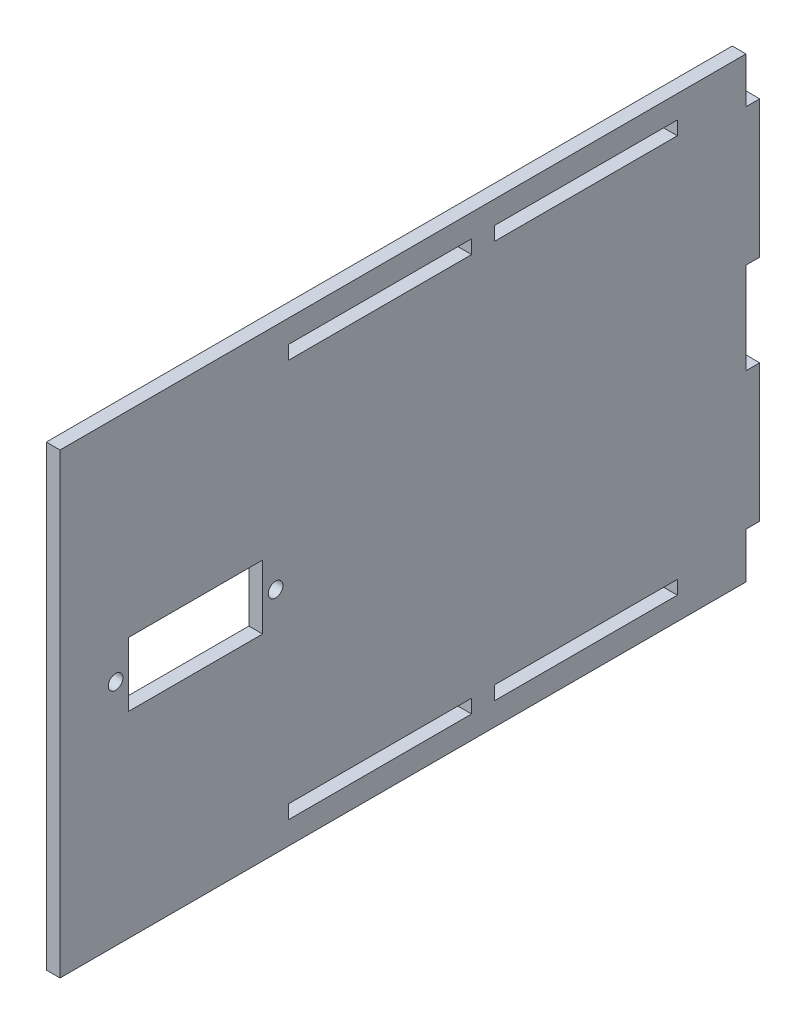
ISO-10303-21;
HEADER;
FILE_DESCRIPTION(('STEP AP214'),'2;1');
FILE_NAME('part.step','',(''),(''),'','','');
FILE_SCHEMA(('AUTOMOTIVE_DESIGN { 1 0 10303 214 1 1 1 1 }'));
ENDSEC;
DATA;
#1=APPLICATION_CONTEXT('core data for automotive mechanical design processes');
#2=APPLICATION_PROTOCOL_DEFINITION('international standard','automotive_design',2000,#1);
#3=PRODUCT_CONTEXT('',#1,'mechanical');
#4=PRODUCT('Part','Part','',(#3));
#5=PRODUCT_RELATED_PRODUCT_CATEGORY('part','',(#4));
#6=PRODUCT_DEFINITION_FORMATION('','',#4);
#7=PRODUCT_DEFINITION_CONTEXT('part definition',#1,'design');
#8=PRODUCT_DEFINITION('design','',#6,#7);
#9=PRODUCT_DEFINITION_SHAPE('','',#8);
#10=(LENGTH_UNIT() NAMED_UNIT(*) SI_UNIT(.MILLI.,.METRE.));
#11=(NAMED_UNIT(*) PLANE_ANGLE_UNIT() SI_UNIT($,.RADIAN.));
#12=(NAMED_UNIT(*) SI_UNIT($,.STERADIAN.) SOLID_ANGLE_UNIT());
#13=UNCERTAINTY_MEASURE_WITH_UNIT(LENGTH_MEASURE(1.E-05),#10,'distance_accuracy_value','');
#14=(GEOMETRIC_REPRESENTATION_CONTEXT(3) GLOBAL_UNCERTAINTY_ASSIGNED_CONTEXT((#13)) GLOBAL_UNIT_ASSIGNED_CONTEXT((#10,
#11,#12)) REPRESENTATION_CONTEXT('',''));
#15=CARTESIAN_POINT('',(0.,0.,0.));
#16=DIRECTION('',(0.,0.,1.));
#17=DIRECTION('',(1.,0.,0.));
#18=AXIS2_PLACEMENT_3D('',#15,#16,#17);
#19=CARTESIAN_POINT('',(0.,0.,0.));
#20=DIRECTION('',(0.,0.,1.));
#21=DIRECTION('',(1.,0.,0.));
#22=AXIS2_PLACEMENT_3D('',#19,#20,#21);
#23=PLANE('',#22);
#24=DIRECTION('',(0.,-1.,0.));
#25=VECTOR('',#24,1.);
#26=CARTESIAN_POINT('',(67.,-50.,0.));
#27=LINE('',#26,#25);
#28=CARTESIAN_POINT('',(67.,-40.,0.));
#29=VERTEX_POINT('',#28);
#30=CARTESIAN_POINT('',(67.,-50.,0.));
#31=VERTEX_POINT('',#30);
#32=EDGE_CURVE('E37',#29,#31,#27,.T.);
#33=ORIENTED_EDGE('',*,*,#32,.F.);
#34=DIRECTION('',(-1.,0.,0.));
#35=VECTOR('',#34,1.);
#36=CARTESIAN_POINT('',(67.,-40.,0.));
#37=LINE('',#36,#35);
#38=CARTESIAN_POINT('',(70.,-40.,0.));
#39=VERTEX_POINT('',#38);
#40=EDGE_CURVE('E440',#39,#29,#37,.T.);
#41=ORIENTED_EDGE('',*,*,#40,.F.);
#42=DIRECTION('',(0.,1.,0.));
#43=VECTOR('',#42,1.);
#44=CARTESIAN_POINT('',(70.,-50.,0.));
#45=LINE('',#44,#43);
#46=CARTESIAN_POINT('',(70.,-50.,0.));
#47=VERTEX_POINT('',#46);
#48=EDGE_CURVE('E482',#47,#39,#45,.T.);
#49=ORIENTED_EDGE('',*,*,#48,.F.);
#50=DIRECTION('',(1.,0.,0.));
#51=VECTOR('',#50,1.);
#52=CARTESIAN_POINT('',(70.,-50.,0.));
#53=LINE('',#52,#51);
#54=EDGE_CURVE('E487',#31,#47,#53,.T.);
#55=ORIENTED_EDGE('',*,*,#54,.F.);
#56=EDGE_LOOP('',(#33,#41,#49,#55));
#57=FACE_BOUND('',#56,.T.);
#58=ADVANCED_FACE('F33',(#57),#23,.F.);
#59=DIRECTION('',(1.,0.,0.));
#60=VECTOR('',#59,1.);
#61=CARTESIAN_POINT('',(70.,40.,0.));
#62=LINE('',#61,#60);
#63=CARTESIAN_POINT('',(67.,40.,0.));
#64=VERTEX_POINT('',#63);
#65=CARTESIAN_POINT('',(70.,40.,0.));
#66=VERTEX_POINT('',#65);
#67=EDGE_CURVE('E466',#64,#66,#62,.T.);
#68=ORIENTED_EDGE('',*,*,#67,.F.);
#69=CARTESIAN_POINT('',(67.,50.,0.));
#70=VERTEX_POINT('',#69);
#71=EDGE_CURVE('E500',#70,#64,#27,.T.);
#72=ORIENTED_EDGE('',*,*,#71,.F.);
#73=DIRECTION('',(-1.,0.,0.));
#74=VECTOR('',#73,1.);
#75=CARTESIAN_POINT('',(70.,50.,0.));
#76=LINE('',#75,#74);
#77=CARTESIAN_POINT('',(70.,50.,0.));
#78=VERTEX_POINT('',#77);
#79=EDGE_CURVE('E488',#78,#70,#76,.T.);
#80=ORIENTED_EDGE('',*,*,#79,.F.);
#81=EDGE_CURVE('E483',#66,#78,#45,.T.);
#82=ORIENTED_EDGE('',*,*,#81,.F.);
#83=EDGE_LOOP('',(#68,#72,#80,#82));
#84=FACE_BOUND('',#83,.T.);
#85=ADVANCED_FACE('F530',(#84),#23,.F.);
#86=CARTESIAN_POINT('',(70.,-10.,0.));
#87=VERTEX_POINT('',#86);
#88=CARTESIAN_POINT('',(70.,9.99999999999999,0.));
#89=VERTEX_POINT('',#88);
#90=EDGE_CURVE('E480',#87,#89,#45,.T.);
#91=ORIENTED_EDGE('',*,*,#90,.F.);
#92=DIRECTION('',(1.,0.,0.));
#93=VECTOR('',#92,1.);
#94=CARTESIAN_POINT('',(70.,-10.,0.));
#95=LINE('',#94,#93);
#96=CARTESIAN_POINT('',(67.,-10.,0.));
#97=VERTEX_POINT('',#96);
#98=EDGE_CURVE('E435',#97,#87,#95,.T.);
#99=ORIENTED_EDGE('',*,*,#98,.F.);
#100=CARTESIAN_POINT('',(67.,9.99999999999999,0.));
#101=VERTEX_POINT('',#100);
#102=EDGE_CURVE('E497',#101,#97,#27,.T.);
#103=ORIENTED_EDGE('',*,*,#102,.F.);
#104=DIRECTION('',(-1.,0.,0.));
#105=VECTOR('',#104,1.);
#106=CARTESIAN_POINT('',(67.,9.99999999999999,0.));
#107=LINE('',#106,#105);
#108=EDGE_CURVE('E552',#89,#101,#107,.T.);
#109=ORIENTED_EDGE('',*,*,#108,.F.);
#110=EDGE_LOOP('',(#91,#99,#103,#109));
#111=FACE_BOUND('',#110,.T.);
#112=ADVANCED_FACE('F560',(#111),#23,.F.);
#113=CARTESIAN_POINT('',(67.,-50.,150.));
#114=DIRECTION('',(1.,0.,0.));
#115=DIRECTION('',(0.,0.,-1.));
#116=AXIS2_PLACEMENT_3D('',#113,#114,#115);
#117=PLANE('',#116);
#118=DIRECTION('',(0.,0.,1.));
#119=VECTOR('',#118,1.);
#120=CARTESIAN_POINT('',(67.,45.,150.));
#121=LINE('',#120,#119);
#122=CARTESIAN_POINT('',(67.,45.,15.));
#123=VERTEX_POINT('',#122);
#124=CARTESIAN_POINT('',(67.,45.,55.));
#125=VERTEX_POINT('',#124);
#126=EDGE_CURVE('E276',#123,#125,#121,.T.);
#127=ORIENTED_EDGE('',*,*,#126,.T.);
#128=DIRECTION('',(0.,-1.,0.));
#129=VECTOR('',#128,1.);
#130=CARTESIAN_POINT('',(67.,-50.,55.));
#131=LINE('',#130,#129);
#132=CARTESIAN_POINT('',(67.,42.,55.));
#133=VERTEX_POINT('',#132);
#134=EDGE_CURVE('E279',#125,#133,#131,.T.);
#135=ORIENTED_EDGE('',*,*,#134,.T.);
#136=DIRECTION('',(0.,0.,-1.));
#137=VECTOR('',#136,1.);
#138=CARTESIAN_POINT('',(67.,42.,150.));
#139=LINE('',#138,#137);
#140=CARTESIAN_POINT('',(67.,42.,15.));
#141=VERTEX_POINT('',#140);
#142=EDGE_CURVE('E271',#133,#141,#139,.T.);
#143=ORIENTED_EDGE('',*,*,#142,.T.);
#144=DIRECTION('',(0.,1.,0.));
#145=VECTOR('',#144,1.);
#146=CARTESIAN_POINT('',(67.,-50.,15.));
#147=LINE('',#146,#145);
#148=EDGE_CURVE('E251',#141,#123,#147,.T.);
#149=ORIENTED_EDGE('',*,*,#148,.T.);
#150=EDGE_LOOP('',(#127,#135,#143,#149));
#151=FACE_BOUND('',#150,.T.);
#152=DIRECTION('',(0.,0.,-1.));
#153=VECTOR('',#152,1.);
#154=CARTESIAN_POINT('',(67.,-45.,150.));
#155=LINE('',#154,#153);
#156=CARTESIAN_POINT('',(67.,-45.,55.));
#157=VERTEX_POINT('',#156);
#158=CARTESIAN_POINT('',(67.,-45.,15.));
#159=VERTEX_POINT('',#158);
#160=EDGE_CURVE('E308',#157,#159,#155,.T.);
#161=ORIENTED_EDGE('',*,*,#160,.T.);
#162=DIRECTION('',(0.,1.,0.));
#163=VECTOR('',#162,1.);
#164=CARTESIAN_POINT('',(67.,-50.,15.));
#165=LINE('',#164,#163);
#166=CARTESIAN_POINT('',(67.,-42.,15.));
#167=VERTEX_POINT('',#166);
#168=EDGE_CURVE('E311',#159,#167,#165,.T.);
#169=ORIENTED_EDGE('',*,*,#168,.T.);
#170=DIRECTION('',(0.,0.,1.));
#171=VECTOR('',#170,1.);
#172=CARTESIAN_POINT('',(67.,-42.,150.));
#173=LINE('',#172,#171);
#174=CARTESIAN_POINT('',(67.,-42.,55.));
#175=VERTEX_POINT('',#174);
#176=EDGE_CURVE('E296',#167,#175,#173,.T.);
#177=ORIENTED_EDGE('',*,*,#176,.T.);
#178=DIRECTION('',(0.,-1.,0.));
#179=VECTOR('',#178,1.);
#180=CARTESIAN_POINT('',(67.,-50.,55.));
#181=LINE('',#180,#179);
#182=EDGE_CURVE('E305',#175,#157,#181,.T.);
#183=ORIENTED_EDGE('',*,*,#182,.T.);
#184=EDGE_LOOP('',(#161,#169,#177,#183));
#185=FACE_BOUND('',#184,.T.);
#186=DIRECTION('',(0.,0.,1.));
#187=VECTOR('',#186,1.);
#188=CARTESIAN_POINT('',(67.,45.,150.));
#189=LINE('',#188,#187);
#190=CARTESIAN_POINT('',(67.,45.,60.));
#191=VERTEX_POINT('',#190);
#192=CARTESIAN_POINT('',(67.,45.,100.));
#193=VERTEX_POINT('',#192);
#194=EDGE_CURVE('E340',#191,#193,#189,.T.);
#195=ORIENTED_EDGE('',*,*,#194,.T.);
#196=DIRECTION('',(0.,-1.,0.));
#197=VECTOR('',#196,1.);
#198=CARTESIAN_POINT('',(67.,-50.,100.));
#199=LINE('',#198,#197);
#200=CARTESIAN_POINT('',(67.,42.,100.));
#201=VERTEX_POINT('',#200);
#202=EDGE_CURVE('E343',#193,#201,#199,.T.);
#203=ORIENTED_EDGE('',*,*,#202,.T.);
#204=DIRECTION('',(0.,0.,-1.));
#205=VECTOR('',#204,1.);
#206=CARTESIAN_POINT('',(67.,42.,150.));
#207=LINE('',#206,#205);
#208=CARTESIAN_POINT('',(67.,42.,60.));
#209=VERTEX_POINT('',#208);
#210=EDGE_CURVE('E328',#201,#209,#207,.T.);
#211=ORIENTED_EDGE('',*,*,#210,.T.);
#212=DIRECTION('',(0.,1.,0.));
#213=VECTOR('',#212,1.);
#214=CARTESIAN_POINT('',(67.,-50.,60.));
#215=LINE('',#214,#213);
#216=EDGE_CURVE('E337',#209,#191,#215,.T.);
#217=ORIENTED_EDGE('',*,*,#216,.T.);
#218=EDGE_LOOP('',(#195,#203,#211,#217));
#219=FACE_BOUND('',#218,.T.);
#220=DIRECTION('',(0.,0.,-1.));
#221=VECTOR('',#220,1.);
#222=CARTESIAN_POINT('',(67.,-45.,150.));
#223=LINE('',#222,#221);
#224=CARTESIAN_POINT('',(67.,-45.,100.));
#225=VERTEX_POINT('',#224);
#226=CARTESIAN_POINT('',(67.,-45.,60.));
#227=VERTEX_POINT('',#226);
#228=EDGE_CURVE('E372',#225,#227,#223,.T.);
#229=ORIENTED_EDGE('',*,*,#228,.T.);
#230=DIRECTION('',(0.,1.,0.));
#231=VECTOR('',#230,1.);
#232=CARTESIAN_POINT('',(67.,-50.,60.));
#233=LINE('',#232,#231);
#234=CARTESIAN_POINT('',(67.,-42.,60.));
#235=VERTEX_POINT('',#234);
#236=EDGE_CURVE('E375',#227,#235,#233,.T.);
#237=ORIENTED_EDGE('',*,*,#236,.T.);
#238=DIRECTION('',(0.,0.,1.));
#239=VECTOR('',#238,1.);
#240=CARTESIAN_POINT('',(67.,-42.,150.));
#241=LINE('',#240,#239);
#242=CARTESIAN_POINT('',(67.,-42.,100.));
#243=VERTEX_POINT('',#242);
#244=EDGE_CURVE('E360',#235,#243,#241,.T.);
#245=ORIENTED_EDGE('',*,*,#244,.T.);
#246=DIRECTION('',(0.,-1.,0.));
#247=VECTOR('',#246,1.);
#248=CARTESIAN_POINT('',(67.,-50.,100.));
#249=LINE('',#248,#247);
#250=EDGE_CURVE('E369',#243,#225,#249,.T.);
#251=ORIENTED_EDGE('',*,*,#250,.T.);
#252=EDGE_LOOP('',(#229,#237,#245,#251));
#253=FACE_BOUND('',#252,.T.);
#254=CARTESIAN_POINT('',(67.,0.,102.85));
#255=DIRECTION('',(1.,0.,0.));
#256=DIRECTION('',(0.,0.,-1.));
#257=AXIS2_PLACEMENT_3D('',#254,#255,#256);
#258=CIRCLE('',#257,1.60000000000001);
#259=CARTESIAN_POINT('',(67.,0.,101.25));
#260=VERTEX_POINT('',#259);
#261=EDGE_CURVE('E381',#260,#260,#258,.T.);
#262=ORIENTED_EDGE('',*,*,#261,.T.);
#263=EDGE_LOOP('',(#262));
#264=FACE_BOUND('',#263,.T.);
#265=CARTESIAN_POINT('',(67.,0.,137.85));
#266=DIRECTION('',(1.,0.,0.));
#267=DIRECTION('',(0.,0.,-1.));
#268=AXIS2_PLACEMENT_3D('',#265,#266,#267);
#269=CIRCLE('',#268,1.59999999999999);
#270=CARTESIAN_POINT('',(67.,0.,136.25));
#271=VERTEX_POINT('',#270);
#272=EDGE_CURVE('E387',#271,#271,#269,.T.);
#273=ORIENTED_EDGE('',*,*,#272,.T.);
#274=EDGE_LOOP('',(#273));
#275=FACE_BOUND('',#274,.T.);
#276=DIRECTION('',(0.,0.,1.));
#277=VECTOR('',#276,1.);
#278=CARTESIAN_POINT('',(67.,6.99999999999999,150.));
#279=LINE('',#278,#277);
#280=CARTESIAN_POINT('',(67.,7.,105.7));
#281=VERTEX_POINT('',#280);
#282=CARTESIAN_POINT('',(67.,7.,135.));
#283=VERTEX_POINT('',#282);
#284=EDGE_CURVE('E416',#281,#283,#279,.T.);
#285=ORIENTED_EDGE('',*,*,#284,.T.);
#286=DIRECTION('',(0.,-1.,0.));
#287=VECTOR('',#286,1.);
#288=CARTESIAN_POINT('',(67.,-50.,135.));
#289=LINE('',#288,#287);
#290=CARTESIAN_POINT('',(67.,-7.,135.));
#291=VERTEX_POINT('',#290);
#292=EDGE_CURVE('E419',#283,#291,#289,.T.);
#293=ORIENTED_EDGE('',*,*,#292,.T.);
#294=DIRECTION('',(0.,0.,-1.));
#295=VECTOR('',#294,1.);
#296=CARTESIAN_POINT('',(67.,-7.00000000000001,150.));
#297=LINE('',#296,#295);
#298=CARTESIAN_POINT('',(67.,-7.,105.7));
#299=VERTEX_POINT('',#298);
#300=EDGE_CURVE('E404',#291,#299,#297,.T.);
#301=ORIENTED_EDGE('',*,*,#300,.T.);
#302=DIRECTION('',(0.,1.,0.));
#303=VECTOR('',#302,1.);
#304=CARTESIAN_POINT('',(67.,-50.,105.7));
#305=LINE('',#304,#303);
#306=EDGE_CURVE('E413',#299,#281,#305,.T.);
#307=ORIENTED_EDGE('',*,*,#306,.T.);
#308=EDGE_LOOP('',(#285,#293,#301,#307));
#309=FACE_BOUND('',#308,.T.);
#310=ORIENTED_EDGE('',*,*,#71,.T.);
#311=DIRECTION('',(0.,0.,-1.));
#312=VECTOR('',#311,1.);
#313=CARTESIAN_POINT('',(67.,40.,30.1496268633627));
#314=LINE('',#313,#312);
#315=CARTESIAN_POINT('',(67.,40.,-3.));
#316=VERTEX_POINT('',#315);
#317=EDGE_CURVE('E471',#64,#316,#314,.T.);
#318=ORIENTED_EDGE('',*,*,#317,.T.);
#319=DIRECTION('',(0.,1.,0.));
#320=VECTOR('',#319,1.);
#321=CARTESIAN_POINT('',(67.,40.,-3.));
#322=LINE('',#321,#320);
#323=CARTESIAN_POINT('',(67.,9.99999999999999,-3.));
#324=VERTEX_POINT('',#323);
#325=EDGE_CURVE('E449',#324,#316,#322,.T.);
#326=ORIENTED_EDGE('',*,*,#325,.F.);
#327=DIRECTION('',(0.,0.,-1.));
#328=VECTOR('',#327,1.);
#329=CARTESIAN_POINT('',(67.,9.99999999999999,30.1496268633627));
#330=LINE('',#329,#328);
#331=EDGE_CURVE('E478',#101,#324,#330,.T.);
#332=ORIENTED_EDGE('',*,*,#331,.F.);
#333=ORIENTED_EDGE('',*,*,#102,.T.);
#334=DIRECTION('',(0.,0.,-1.));
#335=VECTOR('',#334,1.);
#336=CARTESIAN_POINT('',(67.,-10.,30.1496268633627));
#337=LINE('',#336,#335);
#338=CARTESIAN_POINT('',(67.,-10.,-3.));
#339=VERTEX_POINT('',#338);
#340=EDGE_CURVE('E439',#97,#339,#337,.T.);
#341=ORIENTED_EDGE('',*,*,#340,.T.);
#342=DIRECTION('',(0.,1.,0.));
#343=VECTOR('',#342,1.);
#344=CARTESIAN_POINT('',(67.,-10.,-3.));
#345=LINE('',#344,#343);
#346=CARTESIAN_POINT('',(67.,-40.,-3.));
#347=VERTEX_POINT('',#346);
#348=EDGE_CURVE('E423',#347,#339,#345,.T.);
#349=ORIENTED_EDGE('',*,*,#348,.F.);
#350=DIRECTION('',(0.,0.,-1.));
#351=VECTOR('',#350,1.);
#352=CARTESIAN_POINT('',(67.,-40.,30.1496268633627));
#353=LINE('',#352,#351);
#354=EDGE_CURVE('E443',#29,#347,#353,.T.);
#355=ORIENTED_EDGE('',*,*,#354,.F.);
#356=ORIENTED_EDGE('',*,*,#32,.T.);
#357=DIRECTION('',(0.,0.,-1.));
#358=VECTOR('',#357,1.);
#359=CARTESIAN_POINT('',(67.,-50.,150.));
#360=LINE('',#359,#358);
#361=CARTESIAN_POINT('',(67.,-50.,150.));
#362=VERTEX_POINT('',#361);
#363=EDGE_CURVE('E11',#362,#31,#360,.T.);
#364=ORIENTED_EDGE('',*,*,#363,.F.);
#365=DIRECTION('',(0.,-1.,0.));
#366=VECTOR('',#365,1.);
#367=CARTESIAN_POINT('',(67.,-50.,150.));
#368=LINE('',#367,#366);
#369=CARTESIAN_POINT('',(67.,50.,150.));
#370=VERTEX_POINT('',#369);
#371=EDGE_CURVE('E511',#370,#362,#368,.T.);
#372=ORIENTED_EDGE('',*,*,#371,.F.);
#373=DIRECTION('',(0.,0.,-1.));
#374=VECTOR('',#373,1.);
#375=CARTESIAN_POINT('',(67.,50.,150.));
#376=LINE('',#375,#374);
#377=EDGE_CURVE('E507',#370,#70,#376,.T.);
#378=ORIENTED_EDGE('',*,*,#377,.T.);
#379=EDGE_LOOP('',(#310,#318,#326,#332,#333,#341,#349,#355,#356,#364,#372,#378));
#380=FACE_BOUND('',#379,.T.);
#381=ADVANCED_FACE('F35',(#151,#185,#219,#253,#264,#275,#309,#380),#117,.F.);
#382=CARTESIAN_POINT('',(70.,-50.,150.));
#383=DIRECTION('',(0.,1.,0.));
#384=DIRECTION('',(0.,0.,1.));
#385=AXIS2_PLACEMENT_3D('',#382,#383,#384);
#386=PLANE('',#385);
#387=ORIENTED_EDGE('',*,*,#54,.T.);
#388=DIRECTION('',(0.,0.,-1.));
#389=VECTOR('',#388,1.);
#390=CARTESIAN_POINT('',(70.,-50.,150.));
#391=LINE('',#390,#389);
#392=CARTESIAN_POINT('',(70.,-50.,150.));
#393=VERTEX_POINT('',#392);
#394=EDGE_CURVE('E43',#393,#47,#391,.T.);
#395=ORIENTED_EDGE('',*,*,#394,.F.);
#396=DIRECTION('',(1.,0.,0.));
#397=VECTOR('',#396,1.);
#398=CARTESIAN_POINT('',(70.,-50.,150.));
#399=LINE('',#398,#397);
#400=EDGE_CURVE('E510',#362,#393,#399,.T.);
#401=ORIENTED_EDGE('',*,*,#400,.F.);
#402=ORIENTED_EDGE('',*,*,#363,.T.);
#403=EDGE_LOOP('',(#387,#395,#401,#402));
#404=FACE_BOUND('',#403,.T.);
#405=ADVANCED_FACE('F574',(#404),#386,.F.);
#406=CARTESIAN_POINT('',(70.,-50.,150.));
#407=DIRECTION('',(-1.,0.,0.));
#408=DIRECTION('',(0.,0.,1.));
#409=AXIS2_PLACEMENT_3D('',#406,#407,#408);
#410=PLANE('',#409);
#411=DIRECTION('',(0.,0.,-1.));
#412=VECTOR('',#411,1.);
#413=CARTESIAN_POINT('',(70.,42.,55.));
#414=LINE('',#413,#412);
#415=CARTESIAN_POINT('',(70.,42.,55.));
#416=VERTEX_POINT('',#415);
#417=CARTESIAN_POINT('',(70.,42.,15.));
#418=VERTEX_POINT('',#417);
#419=EDGE_CURVE('E257',#416,#418,#414,.T.);
#420=ORIENTED_EDGE('',*,*,#419,.F.);
#421=DIRECTION('',(0.,-1.,0.));
#422=VECTOR('',#421,1.);
#423=CARTESIAN_POINT('',(70.,45.,55.));
#424=LINE('',#423,#422);
#425=CARTESIAN_POINT('',(70.,45.,55.));
#426=VERTEX_POINT('',#425);
#427=EDGE_CURVE('E59',#426,#416,#424,.T.);
#428=ORIENTED_EDGE('',*,*,#427,.F.);
#429=DIRECTION('',(0.,0.,1.));
#430=VECTOR('',#429,1.);
#431=CARTESIAN_POINT('',(70.,45.,55.));
#432=LINE('',#431,#430);
#433=CARTESIAN_POINT('',(70.,45.,15.));
#434=VERTEX_POINT('',#433);
#435=EDGE_CURVE('E264',#434,#426,#432,.T.);
#436=ORIENTED_EDGE('',*,*,#435,.F.);
#437=DIRECTION('',(0.,1.,0.));
#438=VECTOR('',#437,1.);
#439=CARTESIAN_POINT('',(70.,45.,15.));
#440=LINE('',#439,#438);
#441=EDGE_CURVE('E248',#418,#434,#440,.T.);
#442=ORIENTED_EDGE('',*,*,#441,.F.);
#443=EDGE_LOOP('',(#420,#428,#436,#442));
#444=FACE_BOUND('',#443,.T.);
#445=DIRECTION('',(0.,0.,1.));
#446=VECTOR('',#445,1.);
#447=CARTESIAN_POINT('',(70.,-42.,55.));
#448=LINE('',#447,#446);
#449=CARTESIAN_POINT('',(70.,-42.,15.));
#450=VERTEX_POINT('',#449);
#451=CARTESIAN_POINT('',(70.,-42.,55.));
#452=VERTEX_POINT('',#451);
#453=EDGE_CURVE('E284',#450,#452,#448,.T.);
#454=ORIENTED_EDGE('',*,*,#453,.F.);
#455=DIRECTION('',(0.,1.,0.));
#456=VECTOR('',#455,1.);
#457=CARTESIAN_POINT('',(70.,-45.,15.));
#458=LINE('',#457,#456);
#459=CARTESIAN_POINT('',(70.,-45.,15.));
#460=VERTEX_POINT('',#459);
#461=EDGE_CURVE('E282',#460,#450,#458,.T.);
#462=ORIENTED_EDGE('',*,*,#461,.F.);
#463=DIRECTION('',(0.,0.,-1.));
#464=VECTOR('',#463,1.);
#465=CARTESIAN_POINT('',(70.,-45.,55.));
#466=LINE('',#465,#464);
#467=CARTESIAN_POINT('',(70.,-45.,55.));
#468=VERTEX_POINT('',#467);
#469=EDGE_CURVE('E290',#468,#460,#466,.T.);
#470=ORIENTED_EDGE('',*,*,#469,.F.);
#471=DIRECTION('',(0.,-1.,0.));
#472=VECTOR('',#471,1.);
#473=CARTESIAN_POINT('',(70.,-45.,55.));
#474=LINE('',#473,#472);
#475=EDGE_CURVE('E287',#452,#468,#474,.T.);
#476=ORIENTED_EDGE('',*,*,#475,.F.);
#477=EDGE_LOOP('',(#454,#462,#470,#476));
#478=FACE_BOUND('',#477,.T.);
#479=DIRECTION('',(0.,0.,-1.));
#480=VECTOR('',#479,1.);
#481=CARTESIAN_POINT('',(70.,42.,100.));
#482=LINE('',#481,#480);
#483=CARTESIAN_POINT('',(70.,42.,100.));
#484=VERTEX_POINT('',#483);
#485=CARTESIAN_POINT('',(70.,42.,60.));
#486=VERTEX_POINT('',#485);
#487=EDGE_CURVE('E316',#484,#486,#482,.T.);
#488=ORIENTED_EDGE('',*,*,#487,.F.);
#489=DIRECTION('',(0.,-1.,0.));
#490=VECTOR('',#489,1.);
#491=CARTESIAN_POINT('',(70.,45.,100.));
#492=LINE('',#491,#490);
#493=CARTESIAN_POINT('',(70.,45.,100.));
#494=VERTEX_POINT('',#493);
#495=EDGE_CURVE('E314',#494,#484,#492,.T.);
#496=ORIENTED_EDGE('',*,*,#495,.F.);
#497=DIRECTION('',(0.,0.,1.));
#498=VECTOR('',#497,1.);
#499=CARTESIAN_POINT('',(70.,45.,100.));
#500=LINE('',#499,#498);
#501=CARTESIAN_POINT('',(70.,45.,60.));
#502=VERTEX_POINT('',#501);
#503=EDGE_CURVE('E322',#502,#494,#500,.T.);
#504=ORIENTED_EDGE('',*,*,#503,.F.);
#505=DIRECTION('',(0.,1.,0.));
#506=VECTOR('',#505,1.);
#507=CARTESIAN_POINT('',(70.,45.,60.));
#508=LINE('',#507,#506);
#509=EDGE_CURVE('E319',#486,#502,#508,.T.);
#510=ORIENTED_EDGE('',*,*,#509,.F.);
#511=EDGE_LOOP('',(#488,#496,#504,#510));
#512=FACE_BOUND('',#511,.T.);
#513=DIRECTION('',(0.,0.,1.));
#514=VECTOR('',#513,1.);
#515=CARTESIAN_POINT('',(70.,-42.,100.));
#516=LINE('',#515,#514);
#517=CARTESIAN_POINT('',(70.,-42.,60.));
#518=VERTEX_POINT('',#517);
#519=CARTESIAN_POINT('',(70.,-42.,100.));
#520=VERTEX_POINT('',#519);
#521=EDGE_CURVE('E348',#518,#520,#516,.T.);
#522=ORIENTED_EDGE('',*,*,#521,.F.);
#523=DIRECTION('',(0.,1.,0.));
#524=VECTOR('',#523,1.);
#525=CARTESIAN_POINT('',(70.,-45.,60.));
#526=LINE('',#525,#524);
#527=CARTESIAN_POINT('',(70.,-45.,60.));
#528=VERTEX_POINT('',#527);
#529=EDGE_CURVE('E346',#528,#518,#526,.T.);
#530=ORIENTED_EDGE('',*,*,#529,.F.);
#531=DIRECTION('',(0.,0.,-1.));
#532=VECTOR('',#531,1.);
#533=CARTESIAN_POINT('',(70.,-45.,100.));
#534=LINE('',#533,#532);
#535=CARTESIAN_POINT('',(70.,-45.,100.));
#536=VERTEX_POINT('',#535);
#537=EDGE_CURVE('E354',#536,#528,#534,.T.);
#538=ORIENTED_EDGE('',*,*,#537,.F.);
#539=DIRECTION('',(0.,-1.,0.));
#540=VECTOR('',#539,1.);
#541=CARTESIAN_POINT('',(70.,-45.,100.));
#542=LINE('',#541,#540);
#543=EDGE_CURVE('E351',#520,#536,#542,.T.);
#544=ORIENTED_EDGE('',*,*,#543,.F.);
#545=EDGE_LOOP('',(#522,#530,#538,#544));
#546=FACE_BOUND('',#545,.T.);
#547=CARTESIAN_POINT('',(70.,0.,102.85));
#548=DIRECTION('',(1.,0.,0.));
#549=DIRECTION('',(0.,0.,-1.));
#550=AXIS2_PLACEMENT_3D('',#547,#548,#549);
#551=CIRCLE('',#550,1.60000000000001);
#552=CARTESIAN_POINT('',(70.,0.,101.25));
#553=VERTEX_POINT('',#552);
#554=EDGE_CURVE('E378',#553,#553,#551,.T.);
#555=ORIENTED_EDGE('',*,*,#554,.F.);
#556=EDGE_LOOP('',(#555));
#557=FACE_BOUND('',#556,.T.);
#558=CARTESIAN_POINT('',(70.,0.,137.85));
#559=DIRECTION('',(1.,0.,0.));
#560=DIRECTION('',(0.,0.,-1.));
#561=AXIS2_PLACEMENT_3D('',#558,#559,#560);
#562=CIRCLE('',#561,1.59999999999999);
#563=CARTESIAN_POINT('',(70.,0.,136.25));
#564=VERTEX_POINT('',#563);
#565=EDGE_CURVE('E384',#564,#564,#562,.T.);
#566=ORIENTED_EDGE('',*,*,#565,.F.);
#567=EDGE_LOOP('',(#566));
#568=FACE_BOUND('',#567,.T.);
#569=DIRECTION('',(0.,0.,-1.));
#570=VECTOR('',#569,1.);
#571=CARTESIAN_POINT('',(70.,-7.,105.7));
#572=LINE('',#571,#570);
#573=CARTESIAN_POINT('',(70.,-7.,135.));
#574=VERTEX_POINT('',#573);
#575=CARTESIAN_POINT('',(70.,-7.,105.7));
#576=VERTEX_POINT('',#575);
#577=EDGE_CURVE('E392',#574,#576,#572,.T.);
#578=ORIENTED_EDGE('',*,*,#577,.F.);
#579=DIRECTION('',(0.,-1.,0.));
#580=VECTOR('',#579,1.);
#581=CARTESIAN_POINT('',(70.,-7.,135.));
#582=LINE('',#581,#580);
#583=CARTESIAN_POINT('',(70.,7.,135.));
#584=VERTEX_POINT('',#583);
#585=EDGE_CURVE('E390',#584,#574,#582,.T.);
#586=ORIENTED_EDGE('',*,*,#585,.F.);
#587=DIRECTION('',(0.,0.,1.));
#588=VECTOR('',#587,1.);
#589=CARTESIAN_POINT('',(70.,7.,105.7));
#590=LINE('',#589,#588);
#591=CARTESIAN_POINT('',(70.,7.,105.7));
#592=VERTEX_POINT('',#591);
#593=EDGE_CURVE('E398',#592,#584,#590,.T.);
#594=ORIENTED_EDGE('',*,*,#593,.F.);
#595=DIRECTION('',(0.,1.,0.));
#596=VECTOR('',#595,1.);
#597=CARTESIAN_POINT('',(70.,-7.,105.7));
#598=LINE('',#597,#596);
#599=EDGE_CURVE('E395',#576,#592,#598,.T.);
#600=ORIENTED_EDGE('',*,*,#599,.F.);
#601=EDGE_LOOP('',(#578,#586,#594,#600));
#602=FACE_BOUND('',#601,.T.);
#603=ORIENTED_EDGE('',*,*,#48,.T.);
#604=DIRECTION('',(0.,0.,-1.));
#605=VECTOR('',#604,1.);
#606=CARTESIAN_POINT('',(70.,-40.,30.1496268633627));
#607=LINE('',#606,#605);
#608=CARTESIAN_POINT('',(70.,-40.,-3.));
#609=VERTEX_POINT('',#608);
#610=EDGE_CURVE('E426',#39,#609,#607,.T.);
#611=ORIENTED_EDGE('',*,*,#610,.T.);
#612=DIRECTION('',(0.,-1.,0.));
#613=VECTOR('',#612,1.);
#614=CARTESIAN_POINT('',(70.,-40.,-3.));
#615=LINE('',#614,#613);
#616=CARTESIAN_POINT('',(70.,-10.,-3.));
#617=VERTEX_POINT('',#616);
#618=EDGE_CURVE('E430',#617,#609,#615,.T.);
#619=ORIENTED_EDGE('',*,*,#618,.F.);
#620=DIRECTION('',(0.,0.,-1.));
#621=VECTOR('',#620,1.);
#622=CARTESIAN_POINT('',(70.,-10.,30.1496268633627));
#623=LINE('',#622,#621);
#624=EDGE_CURVE('E438',#87,#617,#623,.T.);
#625=ORIENTED_EDGE('',*,*,#624,.F.);
#626=ORIENTED_EDGE('',*,*,#90,.T.);
#627=DIRECTION('',(0.,0.,-1.));
#628=VECTOR('',#627,1.);
#629=CARTESIAN_POINT('',(70.,9.99999999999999,30.1496268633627));
#630=LINE('',#629,#628);
#631=CARTESIAN_POINT('',(70.,9.99999999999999,-3.));
#632=VERTEX_POINT('',#631);
#633=EDGE_CURVE('E452',#89,#632,#630,.T.);
#634=ORIENTED_EDGE('',*,*,#633,.T.);
#635=DIRECTION('',(0.,-1.,0.));
#636=VECTOR('',#635,1.);
#637=CARTESIAN_POINT('',(70.,9.99999999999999,-3.));
#638=LINE('',#637,#636);
#639=CARTESIAN_POINT('',(70.,40.,-3.));
#640=VERTEX_POINT('',#639);
#641=EDGE_CURVE('E456',#640,#632,#638,.T.);
#642=ORIENTED_EDGE('',*,*,#641,.F.);
#643=DIRECTION('',(0.,0.,-1.));
#644=VECTOR('',#643,1.);
#645=CARTESIAN_POINT('',(70.,40.,30.1496268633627));
#646=LINE('',#645,#644);
#647=EDGE_CURVE('E470',#66,#640,#646,.T.);
#648=ORIENTED_EDGE('',*,*,#647,.F.);
#649=ORIENTED_EDGE('',*,*,#81,.T.);
#650=DIRECTION('',(0.,0.,-1.));
#651=VECTOR('',#650,1.);
#652=CARTESIAN_POINT('',(70.,50.,150.));
#653=LINE('',#652,#651);
#654=CARTESIAN_POINT('',(70.,50.,150.));
#655=VERTEX_POINT('',#654);
#656=EDGE_CURVE('E524',#655,#78,#653,.T.);
#657=ORIENTED_EDGE('',*,*,#656,.F.);
#658=DIRECTION('',(0.,1.,0.));
#659=VECTOR('',#658,1.);
#660=CARTESIAN_POINT('',(70.,-50.,150.));
#661=LINE('',#660,#659);
#662=EDGE_CURVE('E508',#393,#655,#661,.T.);
#663=ORIENTED_EDGE('',*,*,#662,.F.);
#664=ORIENTED_EDGE('',*,*,#394,.T.);
#665=EDGE_LOOP('',(#603,#611,#619,#625,#626,#634,#642,#648,#649,#657,#663,#664));
#666=FACE_BOUND('',#665,.T.);
#667=ADVANCED_FACE('F261',(#444,#478,#512,#546,#557,#568,#602,#666),#410,.F.);
#668=CARTESIAN_POINT('',(70.,50.,150.));
#669=DIRECTION('',(0.,-1.,0.));
#670=DIRECTION('',(0.,0.,-1.));
#671=AXIS2_PLACEMENT_3D('',#668,#669,#670);
#672=PLANE('',#671);
#673=ORIENTED_EDGE('',*,*,#79,.T.);
#674=ORIENTED_EDGE('',*,*,#377,.F.);
#675=DIRECTION('',(-1.,0.,0.));
#676=VECTOR('',#675,1.);
#677=CARTESIAN_POINT('',(70.,50.,150.));
#678=LINE('',#677,#676);
#679=EDGE_CURVE('E503',#655,#370,#678,.T.);
#680=ORIENTED_EDGE('',*,*,#679,.F.);
#681=ORIENTED_EDGE('',*,*,#656,.T.);
#682=EDGE_LOOP('',(#673,#674,#680,#681));
#683=FACE_BOUND('',#682,.T.);
#684=ADVANCED_FACE('F521',(#683),#672,.F.);
#685=CARTESIAN_POINT('',(0.,0.,150.));
#686=DIRECTION('',(0.,0.,1.));
#687=DIRECTION('',(1.,0.,0.));
#688=AXIS2_PLACEMENT_3D('',#685,#686,#687);
#689=PLANE('',#688);
#690=ORIENTED_EDGE('',*,*,#371,.T.);
#691=ORIENTED_EDGE('',*,*,#400,.T.);
#692=ORIENTED_EDGE('',*,*,#662,.T.);
#693=ORIENTED_EDGE('',*,*,#679,.T.);
#694=EDGE_LOOP('',(#690,#691,#692,#693));
#695=FACE_BOUND('',#694,.T.);
#696=ADVANCED_FACE('F575',(#695),#689,.T.);
#697=CARTESIAN_POINT('',(0.,0.,-3.));
#698=DIRECTION('',(0.,0.,1.));
#699=DIRECTION('',(1.,0.,0.));
#700=AXIS2_PLACEMENT_3D('',#697,#698,#699);
#701=PLANE('',#700);
#702=DIRECTION('',(1.,0.,0.));
#703=VECTOR('',#702,1.);
#704=CARTESIAN_POINT('',(70.,40.,-3.));
#705=LINE('',#704,#703);
#706=EDGE_CURVE('E448',#316,#640,#705,.T.);
#707=ORIENTED_EDGE('',*,*,#706,.T.);
#708=ORIENTED_EDGE('',*,*,#641,.T.);
#709=DIRECTION('',(-1.,0.,0.));
#710=VECTOR('',#709,1.);
#711=CARTESIAN_POINT('',(67.,9.99999999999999,-3.));
#712=LINE('',#711,#710);
#713=EDGE_CURVE('E453',#632,#324,#712,.T.);
#714=ORIENTED_EDGE('',*,*,#713,.T.);
#715=ORIENTED_EDGE('',*,*,#325,.T.);
#716=EDGE_LOOP('',(#707,#708,#714,#715));
#717=FACE_BOUND('',#716,.T.);
#718=ADVANCED_FACE('F546',(#717),#701,.F.);
#719=CARTESIAN_POINT('',(67.,9.99999999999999,30.1496268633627));
#720=DIRECTION('',(0.,-1.,0.));
#721=DIRECTION('',(0.,0.,-1.));
#722=AXIS2_PLACEMENT_3D('',#719,#720,#721);
#723=PLANE('',#722);
#724=ORIENTED_EDGE('',*,*,#633,.F.);
#725=ORIENTED_EDGE('',*,*,#108,.T.);
#726=ORIENTED_EDGE('',*,*,#331,.T.);
#727=ORIENTED_EDGE('',*,*,#713,.F.);
#728=EDGE_LOOP('',(#724,#725,#726,#727));
#729=FACE_BOUND('',#728,.T.);
#730=ADVANCED_FACE('F550',(#729),#723,.T.);
#731=CARTESIAN_POINT('',(70.,40.,30.1496268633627));
#732=DIRECTION('',(0.,1.,0.));
#733=DIRECTION('',(-1.,0.,0.));
#734=AXIS2_PLACEMENT_3D('',#731,#732,#733);
#735=PLANE('',#734);
#736=ORIENTED_EDGE('',*,*,#317,.F.);
#737=ORIENTED_EDGE('',*,*,#67,.T.);
#738=ORIENTED_EDGE('',*,*,#647,.T.);
#739=ORIENTED_EDGE('',*,*,#706,.F.);
#740=EDGE_LOOP('',(#736,#737,#738,#739));
#741=FACE_BOUND('',#740,.T.);
#742=ADVANCED_FACE('F540',(#741),#735,.T.);
#743=CARTESIAN_POINT('',(0.,0.,-3.));
#744=DIRECTION('',(0.,0.,1.));
#745=DIRECTION('',(1.,0.,0.));
#746=AXIS2_PLACEMENT_3D('',#743,#744,#745);
#747=PLANE('',#746);
#748=DIRECTION('',(1.,0.,0.));
#749=VECTOR('',#748,1.);
#750=CARTESIAN_POINT('',(70.,-10.,-3.));
#751=LINE('',#750,#749);
#752=EDGE_CURVE('E422',#339,#617,#751,.T.);
#753=ORIENTED_EDGE('',*,*,#752,.T.);
#754=ORIENTED_EDGE('',*,*,#618,.T.);
#755=DIRECTION('',(-1.,0.,0.));
#756=VECTOR('',#755,1.);
#757=CARTESIAN_POINT('',(67.,-40.,-3.));
#758=LINE('',#757,#756);
#759=EDGE_CURVE('E427',#609,#347,#758,.T.);
#760=ORIENTED_EDGE('',*,*,#759,.T.);
#761=ORIENTED_EDGE('',*,*,#348,.T.);
#762=EDGE_LOOP('',(#753,#754,#760,#761));
#763=FACE_BOUND('',#762,.T.);
#764=ADVANCED_FACE('F566',(#763),#747,.F.);
#765=CARTESIAN_POINT('',(67.,-40.,30.1496268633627));
#766=DIRECTION('',(0.,-1.,0.));
#767=DIRECTION('',(1.,0.,0.));
#768=AXIS2_PLACEMENT_3D('',#765,#766,#767);
#769=PLANE('',#768);
#770=ORIENTED_EDGE('',*,*,#610,.F.);
#771=ORIENTED_EDGE('',*,*,#40,.T.);
#772=ORIENTED_EDGE('',*,*,#354,.T.);
#773=ORIENTED_EDGE('',*,*,#759,.F.);
#774=EDGE_LOOP('',(#770,#771,#772,#773));
#775=FACE_BOUND('',#774,.T.);
#776=ADVANCED_FACE('F569',(#775),#769,.T.);
#777=CARTESIAN_POINT('',(70.,-10.,30.1496268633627));
#778=DIRECTION('',(0.,1.,0.));
#779=DIRECTION('',(0.,0.,1.));
#780=AXIS2_PLACEMENT_3D('',#777,#778,#779);
#781=PLANE('',#780);
#782=ORIENTED_EDGE('',*,*,#340,.F.);
#783=ORIENTED_EDGE('',*,*,#98,.T.);
#784=ORIENTED_EDGE('',*,*,#624,.T.);
#785=ORIENTED_EDGE('',*,*,#752,.F.);
#786=EDGE_LOOP('',(#782,#783,#784,#785));
#787=FACE_BOUND('',#786,.T.);
#788=ADVANCED_FACE('F564',(#787),#781,.T.);
#789=CARTESIAN_POINT('',(66.99995,-7.,135.));
#790=DIRECTION('',(0.,0.,1.));
#791=DIRECTION('',(1.,0.,0.));
#792=AXIS2_PLACEMENT_3D('',#789,#790,#791);
#793=PLANE('',#792);
#794=DIRECTION('',(1.,0.,0.));
#795=VECTOR('',#794,1.);
#796=CARTESIAN_POINT('',(66.99995,7.,135.));
#797=LINE('',#796,#795);
#798=EDGE_CURVE('E402',#283,#584,#797,.T.);
#799=ORIENTED_EDGE('',*,*,#798,.T.);
#800=ORIENTED_EDGE('',*,*,#585,.T.);
#801=DIRECTION('',(1.,0.,0.));
#802=VECTOR('',#801,1.);
#803=CARTESIAN_POINT('',(66.99995,-7.,135.));
#804=LINE('',#803,#802);
#805=EDGE_CURVE('E401',#291,#574,#804,.T.);
#806=ORIENTED_EDGE('',*,*,#805,.F.);
#807=ORIENTED_EDGE('',*,*,#292,.F.);
#808=EDGE_LOOP('',(#799,#800,#806,#807));
#809=FACE_BOUND('',#808,.T.);
#810=ADVANCED_FACE('F622',(#809),#793,.F.);
#811=CARTESIAN_POINT('',(66.99995,7.,105.7));
#812=DIRECTION('',(0.,1.,0.));
#813=DIRECTION('',(0.,0.,1.));
#814=AXIS2_PLACEMENT_3D('',#811,#812,#813);
#815=PLANE('',#814);
#816=DIRECTION('',(1.,0.,0.));
#817=VECTOR('',#816,1.);
#818=CARTESIAN_POINT('',(66.99995,7.,105.7));
#819=LINE('',#818,#817);
#820=EDGE_CURVE('E405',#281,#592,#819,.T.);
#821=ORIENTED_EDGE('',*,*,#820,.T.);
#822=ORIENTED_EDGE('',*,*,#593,.T.);
#823=ORIENTED_EDGE('',*,*,#798,.F.);
#824=ORIENTED_EDGE('',*,*,#284,.F.);
#825=EDGE_LOOP('',(#821,#822,#823,#824));
#826=FACE_BOUND('',#825,.T.);
#827=ADVANCED_FACE('F612',(#826),#815,.F.);
#828=CARTESIAN_POINT('',(66.99995,-7.,105.7));
#829=DIRECTION('',(0.,0.,-1.));
#830=DIRECTION('',(-1.,0.,0.));
#831=AXIS2_PLACEMENT_3D('',#828,#829,#830);
#832=PLANE('',#831);
#833=DIRECTION('',(1.,0.,0.));
#834=VECTOR('',#833,1.);
#835=CARTESIAN_POINT('',(66.99995,-7.,105.7));
#836=LINE('',#835,#834);
#837=EDGE_CURVE('E407',#299,#576,#836,.T.);
#838=ORIENTED_EDGE('',*,*,#837,.T.);
#839=ORIENTED_EDGE('',*,*,#599,.T.);
#840=ORIENTED_EDGE('',*,*,#820,.F.);
#841=ORIENTED_EDGE('',*,*,#306,.F.);
#842=EDGE_LOOP('',(#838,#839,#840,#841));
#843=FACE_BOUND('',#842,.T.);
#844=ADVANCED_FACE('F614',(#843),#832,.F.);
#845=CARTESIAN_POINT('',(66.99995,-7.,105.7));
#846=DIRECTION('',(0.,-1.,0.));
#847=DIRECTION('',(0.,0.,-1.));
#848=AXIS2_PLACEMENT_3D('',#845,#846,#847);
#849=PLANE('',#848);
#850=ORIENTED_EDGE('',*,*,#805,.T.);
#851=ORIENTED_EDGE('',*,*,#577,.T.);
#852=ORIENTED_EDGE('',*,*,#837,.F.);
#853=ORIENTED_EDGE('',*,*,#300,.F.);
#854=EDGE_LOOP('',(#850,#851,#852,#853));
#855=FACE_BOUND('',#854,.T.);
#856=ADVANCED_FACE('F624',(#855),#849,.F.);
#857=CARTESIAN_POINT('',(66.99995,0.,137.85));
#858=DIRECTION('',(1.,0.,0.));
#859=DIRECTION('',(0.,0.,-1.));
#860=AXIS2_PLACEMENT_3D('',#857,#858,#859);
#861=CYLINDRICAL_SURFACE('',#860,1.59999999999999);
#862=CARTESIAN_POINT('',(70.,0.,136.25));
#863=CARTESIAN_POINT('',(69.9687500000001,0.,136.25));
#864=CARTESIAN_POINT('',(69.9375,0.,136.25));
#865=CARTESIAN_POINT('',(69.875,0.,136.25));
#866=CARTESIAN_POINT('',(69.84375,0.,136.25));
#867=CARTESIAN_POINT('',(69.78125,0.,136.25));
#868=CARTESIAN_POINT('',(69.75,0.,136.25));
#869=CARTESIAN_POINT('',(69.6875,0.,136.25));
#870=CARTESIAN_POINT('',(69.65625,0.,136.25));
#871=CARTESIAN_POINT('',(69.5937500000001,0.,136.25));
#872=CARTESIAN_POINT('',(69.5625,0.,136.25));
#873=CARTESIAN_POINT('',(69.5,0.,136.25));
#874=CARTESIAN_POINT('',(69.46875,0.,136.25));
#875=CARTESIAN_POINT('',(69.40625,0.,136.25));
#876=CARTESIAN_POINT('',(69.375,0.,136.25));
#877=CARTESIAN_POINT('',(69.3125,0.,136.25));
#878=CARTESIAN_POINT('',(69.28125,0.,136.25));
#879=CARTESIAN_POINT('',(69.2187500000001,0.,136.25));
#880=CARTESIAN_POINT('',(69.1875,0.,136.25));
#881=CARTESIAN_POINT('',(69.125,0.,136.25));
#882=CARTESIAN_POINT('',(69.09375,0.,136.25));
#883=CARTESIAN_POINT('',(69.03125,0.,136.25));
#884=CARTESIAN_POINT('',(69.,0.,136.25));
#885=CARTESIAN_POINT('',(68.9375,0.,136.25));
#886=CARTESIAN_POINT('',(68.90625,0.,136.25));
#887=CARTESIAN_POINT('',(68.8437500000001,0.,136.25));
#888=CARTESIAN_POINT('',(68.8125,0.,136.25));
#889=CARTESIAN_POINT('',(68.75,0.,136.25));
#890=CARTESIAN_POINT('',(68.71875,0.,136.25));
#891=CARTESIAN_POINT('',(68.65625,0.,136.25));
#892=CARTESIAN_POINT('',(68.625,0.,136.25));
#893=CARTESIAN_POINT('',(68.5625,0.,136.25));
#894=CARTESIAN_POINT('',(68.53125,0.,136.25));
#895=CARTESIAN_POINT('',(68.4687500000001,0.,136.25));
#896=CARTESIAN_POINT('',(68.4375,0.,136.25));
#897=CARTESIAN_POINT('',(68.375,0.,136.25));
#898=CARTESIAN_POINT('',(68.34375,0.,136.25));
#899=CARTESIAN_POINT('',(68.28125,0.,136.25));
#900=CARTESIAN_POINT('',(68.25,0.,136.25));
#901=CARTESIAN_POINT('',(68.1875,0.,136.25));
#902=CARTESIAN_POINT('',(68.15625,0.,136.25));
#903=CARTESIAN_POINT('',(68.0937500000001,0.,136.25));
#904=CARTESIAN_POINT('',(68.0625,0.,136.25));
#905=CARTESIAN_POINT('',(68.,0.,136.25));
#906=CARTESIAN_POINT('',(67.96875,0.,136.25));
#907=CARTESIAN_POINT('',(67.90625,0.,136.25));
#908=CARTESIAN_POINT('',(67.875,0.,136.25));
#909=CARTESIAN_POINT('',(67.8125,0.,136.25));
#910=CARTESIAN_POINT('',(67.78125,0.,136.25));
#911=CARTESIAN_POINT('',(67.71875,0.,136.25));
#912=CARTESIAN_POINT('',(67.6875,0.,136.25));
#913=CARTESIAN_POINT('',(67.625,0.,136.25));
#914=CARTESIAN_POINT('',(67.59375,0.,136.25));
#915=CARTESIAN_POINT('',(67.53125,0.,136.25));
#916=CARTESIAN_POINT('',(67.5,0.,136.25));
#917=CARTESIAN_POINT('',(67.4375,0.,136.25));
#918=CARTESIAN_POINT('',(67.40625,0.,136.25));
#919=CARTESIAN_POINT('',(67.34375,0.,136.25));
#920=CARTESIAN_POINT('',(67.3125,0.,136.25));
#921=CARTESIAN_POINT('',(67.25,0.,136.25));
#922=CARTESIAN_POINT('',(67.21875,0.,136.25));
#923=CARTESIAN_POINT('',(67.15625,0.,136.25));
#924=CARTESIAN_POINT('',(67.125,0.,136.25));
#925=CARTESIAN_POINT('',(67.0625,0.,136.25));
#926=CARTESIAN_POINT('',(67.03125,0.,136.25));
#927=CARTESIAN_POINT('',(67.,0.,136.25));
#928=B_SPLINE_CURVE_WITH_KNOTS('',3,(#862,#863,#864,#865,#866,#867,#868,#869,#870,#871,#872,
#873,#874,#875,#876,#877,#878,#879,#880,#881,#882,#883,#884,#885,#886,#887,#888,#889,#890,#891,
#892,#893,#894,#895,#896,#897,#898,#899,#900,#901,#902,#903,#904,#905,#906,#907,#908,#909,#910,
#911,#912,#913,#914,#915,#916,#917,#918,#919,#920,#921,#922,#923,#924,#925,#926,#927),
.UNSPECIFIED.,.F.,.F.,(4,2,2,2,2,2,2,2,2,2,2,2,2,2,2,2,2,2,2,2,2,2,2,2,2,2,2,2,2,2,2,2,4),(0.,
0.0937500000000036,0.187500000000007,0.281250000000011,0.375,0.468750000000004,
0.562500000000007,0.656250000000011,0.750000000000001,0.843750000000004,0.937500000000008,
1.03125000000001,1.125,1.21875,1.31250000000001,1.40625000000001,1.5,1.59375,1.68750000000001,
1.78125000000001,1.875,1.96875000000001,2.06250000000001,2.15625000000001,2.25000000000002,
2.34375000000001,2.43750000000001,2.53125000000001,2.62500000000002,2.71875000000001,
2.81250000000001,2.90625000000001,3.00000000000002),.UNSPECIFIED.);
#929=EDGE_CURVE('BSEAM626',#564,#271,#928,.T.);
#930=ORIENTED_EDGE('',*,*,#565,.T.);
#931=ORIENTED_EDGE('',*,*,#272,.F.);
#932=ORIENTED_EDGE('',*,*,#929,.T.);
#933=ORIENTED_EDGE('',*,*,#929,.F.);
#934=EDGE_LOOP('',(#930,#932,#931,#933));
#935=FACE_BOUND('',#934,.T.);
#936=ADVANCED_FACE('F626',(#935),#861,.F.);
#937=CARTESIAN_POINT('',(66.99995,0.,102.85));
#938=DIRECTION('',(1.,0.,0.));
#939=DIRECTION('',(0.,0.,-1.));
#940=AXIS2_PLACEMENT_3D('',#937,#938,#939);
#941=CYLINDRICAL_SURFACE('',#940,1.60000000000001);
#942=CARTESIAN_POINT('',(70.,0.,101.25));
#943=CARTESIAN_POINT('',(69.9687500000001,0.,101.25));
#944=CARTESIAN_POINT('',(69.9375,0.,101.25));
#945=CARTESIAN_POINT('',(69.875,0.,101.25));
#946=CARTESIAN_POINT('',(69.84375,0.,101.25));
#947=CARTESIAN_POINT('',(69.78125,0.,101.25));
#948=CARTESIAN_POINT('',(69.75,0.,101.25));
#949=CARTESIAN_POINT('',(69.6875,0.,101.25));
#950=CARTESIAN_POINT('',(69.65625,0.,101.25));
#951=CARTESIAN_POINT('',(69.5937500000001,0.,101.25));
#952=CARTESIAN_POINT('',(69.5625,0.,101.25));
#953=CARTESIAN_POINT('',(69.5,0.,101.25));
#954=CARTESIAN_POINT('',(69.46875,0.,101.25));
#955=CARTESIAN_POINT('',(69.40625,0.,101.25));
#956=CARTESIAN_POINT('',(69.375,0.,101.25));
#957=CARTESIAN_POINT('',(69.3125,0.,101.25));
#958=CARTESIAN_POINT('',(69.28125,0.,101.25));
#959=CARTESIAN_POINT('',(69.2187500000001,0.,101.25));
#960=CARTESIAN_POINT('',(69.1875,0.,101.25));
#961=CARTESIAN_POINT('',(69.125,0.,101.25));
#962=CARTESIAN_POINT('',(69.09375,0.,101.25));
#963=CARTESIAN_POINT('',(69.03125,0.,101.25));
#964=CARTESIAN_POINT('',(69.,0.,101.25));
#965=CARTESIAN_POINT('',(68.9375,0.,101.25));
#966=CARTESIAN_POINT('',(68.90625,0.,101.25));
#967=CARTESIAN_POINT('',(68.8437500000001,0.,101.25));
#968=CARTESIAN_POINT('',(68.8125,0.,101.25));
#969=CARTESIAN_POINT('',(68.75,0.,101.25));
#970=CARTESIAN_POINT('',(68.71875,0.,101.25));
#971=CARTESIAN_POINT('',(68.65625,0.,101.25));
#972=CARTESIAN_POINT('',(68.625,0.,101.25));
#973=CARTESIAN_POINT('',(68.5625,0.,101.25));
#974=CARTESIAN_POINT('',(68.53125,0.,101.25));
#975=CARTESIAN_POINT('',(68.4687500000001,0.,101.25));
#976=CARTESIAN_POINT('',(68.4375,0.,101.25));
#977=CARTESIAN_POINT('',(68.375,0.,101.25));
#978=CARTESIAN_POINT('',(68.34375,0.,101.25));
#979=CARTESIAN_POINT('',(68.28125,0.,101.25));
#980=CARTESIAN_POINT('',(68.25,0.,101.25));
#981=CARTESIAN_POINT('',(68.1875,0.,101.25));
#982=CARTESIAN_POINT('',(68.15625,0.,101.25));
#983=CARTESIAN_POINT('',(68.0937500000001,0.,101.25));
#984=CARTESIAN_POINT('',(68.0625,0.,101.25));
#985=CARTESIAN_POINT('',(68.,0.,101.25));
#986=CARTESIAN_POINT('',(67.96875,0.,101.25));
#987=CARTESIAN_POINT('',(67.90625,0.,101.25));
#988=CARTESIAN_POINT('',(67.875,0.,101.25));
#989=CARTESIAN_POINT('',(67.8125,0.,101.25));
#990=CARTESIAN_POINT('',(67.78125,0.,101.25));
#991=CARTESIAN_POINT('',(67.71875,0.,101.25));
#992=CARTESIAN_POINT('',(67.6875,0.,101.25));
#993=CARTESIAN_POINT('',(67.625,0.,101.25));
#994=CARTESIAN_POINT('',(67.59375,0.,101.25));
#995=CARTESIAN_POINT('',(67.53125,0.,101.25));
#996=CARTESIAN_POINT('',(67.5,0.,101.25));
#997=CARTESIAN_POINT('',(67.4375,0.,101.25));
#998=CARTESIAN_POINT('',(67.40625,0.,101.25));
#999=CARTESIAN_POINT('',(67.34375,0.,101.25));
#1000=CARTESIAN_POINT('',(67.3125,0.,101.25));
#1001=CARTESIAN_POINT('',(67.25,0.,101.25));
#1002=CARTESIAN_POINT('',(67.21875,0.,101.25));
#1003=CARTESIAN_POINT('',(67.15625,0.,101.25));
#1004=CARTESIAN_POINT('',(67.125,0.,101.25));
#1005=CARTESIAN_POINT('',(67.0625,0.,101.25));
#1006=CARTESIAN_POINT('',(67.03125,0.,101.25));
#1007=CARTESIAN_POINT('',(67.,0.,101.25));
#1008=B_SPLINE_CURVE_WITH_KNOTS('',3,(#942,#943,#944,#945,#946,#947,#948,#949,#950,#951,#952,
#953,#954,#955,#956,#957,#958,#959,#960,#961,#962,#963,#964,#965,#966,#967,#968,#969,#970,#971,
#972,#973,#974,#975,#976,#977,#978,#979,#980,#981,#982,#983,#984,#985,#986,#987,#988,#989,#990,
#991,#992,#993,#994,#995,#996,#997,#998,#999,#1000,#1001,#1002,#1003,#1004,#1005,#1006,#1007),
.UNSPECIFIED.,.F.,.F.,(4,2,2,2,2,2,2,2,2,2,2,2,2,2,2,2,2,2,2,2,2,2,2,2,2,2,2,2,2,2,2,2,4),(0.,
0.0937500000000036,0.187500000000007,0.281250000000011,0.375,0.468750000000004,
0.562500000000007,0.656250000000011,0.750000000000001,0.843750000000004,0.937500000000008,
1.03125000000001,1.125,1.21875,1.31250000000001,1.40625000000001,1.5,1.59375,1.68750000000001,
1.78125000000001,1.875,1.96875000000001,2.06250000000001,2.15625000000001,2.25000000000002,
2.34375000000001,2.43750000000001,2.53125000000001,2.62500000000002,2.71875000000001,
2.81250000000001,2.90625000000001,3.00000000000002),.UNSPECIFIED.);
#1009=EDGE_CURVE('BSEAM632',#553,#260,#1008,.T.);
#1010=ORIENTED_EDGE('',*,*,#554,.T.);
#1011=ORIENTED_EDGE('',*,*,#261,.F.);
#1012=ORIENTED_EDGE('',*,*,#1009,.T.);
#1013=ORIENTED_EDGE('',*,*,#1009,.F.);
#1014=EDGE_LOOP('',(#1010,#1012,#1011,#1013));
#1015=FACE_BOUND('',#1014,.T.);
#1016=ADVANCED_FACE('F632',(#1015),#941,.F.);
#1017=CARTESIAN_POINT('',(66.99995,-45.,60.));
#1018=DIRECTION('',(0.,0.,-1.));
#1019=DIRECTION('',(-1.,0.,0.));
#1020=AXIS2_PLACEMENT_3D('',#1017,#1018,#1019);
#1021=PLANE('',#1020);
#1022=DIRECTION('',(1.,0.,0.));
#1023=VECTOR('',#1022,1.);
#1024=CARTESIAN_POINT('',(66.99995,-45.,60.));
#1025=LINE('',#1024,#1023);
#1026=EDGE_CURVE('E358',#227,#528,#1025,.T.);
#1027=ORIENTED_EDGE('',*,*,#1026,.T.);
#1028=ORIENTED_EDGE('',*,*,#529,.T.);
#1029=DIRECTION('',(1.,0.,0.));
#1030=VECTOR('',#1029,1.);
#1031=CARTESIAN_POINT('',(66.99995,-42.,60.));
#1032=LINE('',#1031,#1030);
#1033=EDGE_CURVE('E357',#235,#518,#1032,.T.);
#1034=ORIENTED_EDGE('',*,*,#1033,.F.);
#1035=ORIENTED_EDGE('',*,*,#236,.F.);
#1036=EDGE_LOOP('',(#1027,#1028,#1034,#1035));
#1037=FACE_BOUND('',#1036,.T.);
#1038=ADVANCED_FACE('F699',(#1037),#1021,.F.);
#1039=CARTESIAN_POINT('',(66.99995,-45.,100.));
#1040=DIRECTION('',(0.,-1.,0.));
#1041=DIRECTION('',(0.,0.,-1.));
#1042=AXIS2_PLACEMENT_3D('',#1039,#1040,#1041);
#1043=PLANE('',#1042);
#1044=DIRECTION('',(1.,0.,0.));
#1045=VECTOR('',#1044,1.);
#1046=CARTESIAN_POINT('',(66.99995,-45.,100.));
#1047=LINE('',#1046,#1045);
#1048=EDGE_CURVE('E361',#225,#536,#1047,.T.);
#1049=ORIENTED_EDGE('',*,*,#1048,.T.);
#1050=ORIENTED_EDGE('',*,*,#537,.T.);
#1051=ORIENTED_EDGE('',*,*,#1026,.F.);
#1052=ORIENTED_EDGE('',*,*,#228,.F.);
#1053=EDGE_LOOP('',(#1049,#1050,#1051,#1052));
#1054=FACE_BOUND('',#1053,.T.);
#1055=ADVANCED_FACE('F725',(#1054),#1043,.F.);
#1056=CARTESIAN_POINT('',(66.99995,-45.,100.));
#1057=DIRECTION('',(0.,0.,1.));
#1058=DIRECTION('',(1.,0.,0.));
#1059=AXIS2_PLACEMENT_3D('',#1056,#1057,#1058);
#1060=PLANE('',#1059);
#1061=DIRECTION('',(1.,0.,0.));
#1062=VECTOR('',#1061,1.);
#1063=CARTESIAN_POINT('',(66.99995,-42.,100.));
#1064=LINE('',#1063,#1062);
#1065=EDGE_CURVE('E363',#243,#520,#1064,.T.);
#1066=ORIENTED_EDGE('',*,*,#1065,.T.);
#1067=ORIENTED_EDGE('',*,*,#543,.T.);
#1068=ORIENTED_EDGE('',*,*,#1048,.F.);
#1069=ORIENTED_EDGE('',*,*,#250,.F.);
#1070=EDGE_LOOP('',(#1066,#1067,#1068,#1069));
#1071=FACE_BOUND('',#1070,.T.);
#1072=ADVANCED_FACE('F735',(#1071),#1060,.F.);
#1073=CARTESIAN_POINT('',(66.99995,-42.,100.));
#1074=DIRECTION('',(0.,1.,0.));
#1075=DIRECTION('',(0.,0.,1.));
#1076=AXIS2_PLACEMENT_3D('',#1073,#1074,#1075);
#1077=PLANE('',#1076);
#1078=ORIENTED_EDGE('',*,*,#1033,.T.);
#1079=ORIENTED_EDGE('',*,*,#521,.T.);
#1080=ORIENTED_EDGE('',*,*,#1065,.F.);
#1081=ORIENTED_EDGE('',*,*,#244,.F.);
#1082=EDGE_LOOP('',(#1078,#1079,#1080,#1081));
#1083=FACE_BOUND('',#1082,.T.);
#1084=ADVANCED_FACE('F745',(#1083),#1077,.F.);
#1085=CARTESIAN_POINT('',(66.99995,45.,100.));
#1086=DIRECTION('',(0.,0.,1.));
#1087=DIRECTION('',(1.,0.,0.));
#1088=AXIS2_PLACEMENT_3D('',#1085,#1086,#1087);
#1089=PLANE('',#1088);
#1090=DIRECTION('',(1.,0.,0.));
#1091=VECTOR('',#1090,1.);
#1092=CARTESIAN_POINT('',(66.99995,45.,100.));
#1093=LINE('',#1092,#1091);
#1094=EDGE_CURVE('E326',#193,#494,#1093,.T.);
#1095=ORIENTED_EDGE('',*,*,#1094,.T.);
#1096=ORIENTED_EDGE('',*,*,#495,.T.);
#1097=DIRECTION('',(1.,0.,0.));
#1098=VECTOR('',#1097,1.);
#1099=CARTESIAN_POINT('',(66.99995,42.,100.));
#1100=LINE('',#1099,#1098);
#1101=EDGE_CURVE('E325',#201,#484,#1100,.T.);
#1102=ORIENTED_EDGE('',*,*,#1101,.F.);
#1103=ORIENTED_EDGE('',*,*,#202,.F.);
#1104=EDGE_LOOP('',(#1095,#1096,#1102,#1103));
#1105=FACE_BOUND('',#1104,.T.);
#1106=ADVANCED_FACE('F755',(#1105),#1089,.F.);
#1107=CARTESIAN_POINT('',(66.99995,45.,100.));
#1108=DIRECTION('',(0.,1.,0.));
#1109=DIRECTION('',(0.,0.,1.));
#1110=AXIS2_PLACEMENT_3D('',#1107,#1108,#1109);
#1111=PLANE('',#1110);
#1112=DIRECTION('',(1.,0.,0.));
#1113=VECTOR('',#1112,1.);
#1114=CARTESIAN_POINT('',(66.99995,45.,60.));
#1115=LINE('',#1114,#1113);
#1116=EDGE_CURVE('E329',#191,#502,#1115,.T.);
#1117=ORIENTED_EDGE('',*,*,#1116,.T.);
#1118=ORIENTED_EDGE('',*,*,#503,.T.);
#1119=ORIENTED_EDGE('',*,*,#1094,.F.);
#1120=ORIENTED_EDGE('',*,*,#194,.F.);
#1121=EDGE_LOOP('',(#1117,#1118,#1119,#1120));
#1122=FACE_BOUND('',#1121,.T.);
#1123=ADVANCED_FACE('F765',(#1122),#1111,.F.);
#1124=CARTESIAN_POINT('',(66.99995,45.,60.));
#1125=DIRECTION('',(0.,0.,-1.));
#1126=DIRECTION('',(-1.,0.,0.));
#1127=AXIS2_PLACEMENT_3D('',#1124,#1125,#1126);
#1128=PLANE('',#1127);
#1129=DIRECTION('',(1.,0.,0.));
#1130=VECTOR('',#1129,1.);
#1131=CARTESIAN_POINT('',(66.99995,42.,60.));
#1132=LINE('',#1131,#1130);
#1133=EDGE_CURVE('E331',#209,#486,#1132,.T.);
#1134=ORIENTED_EDGE('',*,*,#1133,.T.);
#1135=ORIENTED_EDGE('',*,*,#509,.T.);
#1136=ORIENTED_EDGE('',*,*,#1116,.F.);
#1137=ORIENTED_EDGE('',*,*,#216,.F.);
#1138=EDGE_LOOP('',(#1134,#1135,#1136,#1137));
#1139=FACE_BOUND('',#1138,.T.);
#1140=ADVANCED_FACE('F775',(#1139),#1128,.F.);
#1141=CARTESIAN_POINT('',(66.99995,42.,100.));
#1142=DIRECTION('',(0.,-1.,0.));
#1143=DIRECTION('',(0.,0.,-1.));
#1144=AXIS2_PLACEMENT_3D('',#1141,#1142,#1143);
#1145=PLANE('',#1144);
#1146=ORIENTED_EDGE('',*,*,#1101,.T.);
#1147=ORIENTED_EDGE('',*,*,#487,.T.);
#1148=ORIENTED_EDGE('',*,*,#1133,.F.);
#1149=ORIENTED_EDGE('',*,*,#210,.F.);
#1150=EDGE_LOOP('',(#1146,#1147,#1148,#1149));
#1151=FACE_BOUND('',#1150,.T.);
#1152=ADVANCED_FACE('F785',(#1151),#1145,.F.);
#1153=CARTESIAN_POINT('',(66.99995,-45.,15.));
#1154=DIRECTION('',(0.,0.,-1.));
#1155=DIRECTION('',(-1.,0.,0.));
#1156=AXIS2_PLACEMENT_3D('',#1153,#1154,#1155);
#1157=PLANE('',#1156);
#1158=DIRECTION('',(1.,0.,0.));
#1159=VECTOR('',#1158,1.);
#1160=CARTESIAN_POINT('',(66.99995,-45.,15.));
#1161=LINE('',#1160,#1159);
#1162=EDGE_CURVE('E294',#159,#460,#1161,.T.);
#1163=ORIENTED_EDGE('',*,*,#1162,.T.);
#1164=ORIENTED_EDGE('',*,*,#461,.T.);
#1165=DIRECTION('',(1.,0.,0.));
#1166=VECTOR('',#1165,1.);
#1167=CARTESIAN_POINT('',(66.99995,-42.,15.));
#1168=LINE('',#1167,#1166);
#1169=EDGE_CURVE('E293',#167,#450,#1168,.T.);
#1170=ORIENTED_EDGE('',*,*,#1169,.F.);
#1171=ORIENTED_EDGE('',*,*,#168,.F.);
#1172=EDGE_LOOP('',(#1163,#1164,#1170,#1171));
#1173=FACE_BOUND('',#1172,.T.);
#1174=ADVANCED_FACE('F795',(#1173),#1157,.F.);
#1175=CARTESIAN_POINT('',(66.99995,-45.,55.));
#1176=DIRECTION('',(0.,-1.,0.));
#1177=DIRECTION('',(0.,0.,-1.));
#1178=AXIS2_PLACEMENT_3D('',#1175,#1176,#1177);
#1179=PLANE('',#1178);
#1180=DIRECTION('',(1.,0.,0.));
#1181=VECTOR('',#1180,1.);
#1182=CARTESIAN_POINT('',(66.99995,-45.,55.));
#1183=LINE('',#1182,#1181);
#1184=EDGE_CURVE('E297',#157,#468,#1183,.T.);
#1185=ORIENTED_EDGE('',*,*,#1184,.T.);
#1186=ORIENTED_EDGE('',*,*,#469,.T.);
#1187=ORIENTED_EDGE('',*,*,#1162,.F.);
#1188=ORIENTED_EDGE('',*,*,#160,.F.);
#1189=EDGE_LOOP('',(#1185,#1186,#1187,#1188));
#1190=FACE_BOUND('',#1189,.T.);
#1191=ADVANCED_FACE('F805',(#1190),#1179,.F.);
#1192=CARTESIAN_POINT('',(66.99995,-45.,55.));
#1193=DIRECTION('',(0.,0.,1.));
#1194=DIRECTION('',(1.,0.,0.));
#1195=AXIS2_PLACEMENT_3D('',#1192,#1193,#1194);
#1196=PLANE('',#1195);
#1197=DIRECTION('',(1.,0.,0.));
#1198=VECTOR('',#1197,1.);
#1199=CARTESIAN_POINT('',(66.99995,-42.,55.));
#1200=LINE('',#1199,#1198);
#1201=EDGE_CURVE('E299',#175,#452,#1200,.T.);
#1202=ORIENTED_EDGE('',*,*,#1201,.T.);
#1203=ORIENTED_EDGE('',*,*,#475,.T.);
#1204=ORIENTED_EDGE('',*,*,#1184,.F.);
#1205=ORIENTED_EDGE('',*,*,#182,.F.);
#1206=EDGE_LOOP('',(#1202,#1203,#1204,#1205));
#1207=FACE_BOUND('',#1206,.T.);
#1208=ADVANCED_FACE('F815',(#1207),#1196,.F.);
#1209=CARTESIAN_POINT('',(66.99995,-42.,55.));
#1210=DIRECTION('',(0.,1.,0.));
#1211=DIRECTION('',(0.,0.,1.));
#1212=AXIS2_PLACEMENT_3D('',#1209,#1210,#1211);
#1213=PLANE('',#1212);
#1214=ORIENTED_EDGE('',*,*,#1169,.T.);
#1215=ORIENTED_EDGE('',*,*,#453,.T.);
#1216=ORIENTED_EDGE('',*,*,#1201,.F.);
#1217=ORIENTED_EDGE('',*,*,#176,.F.);
#1218=EDGE_LOOP('',(#1214,#1215,#1216,#1217));
#1219=FACE_BOUND('',#1218,.T.);
#1220=ADVANCED_FACE('F825',(#1219),#1213,.F.);
#1221=CARTESIAN_POINT('',(66.99995,45.,55.));
#1222=DIRECTION('',(0.,0.,1.));
#1223=DIRECTION('',(1.,0.,0.));
#1224=AXIS2_PLACEMENT_3D('',#1221,#1222,#1223);
#1225=PLANE('',#1224);
#1226=DIRECTION('',(1.,0.,0.));
#1227=VECTOR('',#1226,1.);
#1228=CARTESIAN_POINT('',(66.99995,45.,55.));
#1229=LINE('',#1228,#1227);
#1230=EDGE_CURVE('E269',#125,#426,#1229,.T.);
#1231=ORIENTED_EDGE('',*,*,#1230,.T.);
#1232=ORIENTED_EDGE('',*,*,#427,.T.);
#1233=DIRECTION('',(1.,0.,0.));
#1234=VECTOR('',#1233,1.);
#1235=CARTESIAN_POINT('',(66.99995,42.,55.));
#1236=LINE('',#1235,#1234);
#1237=EDGE_CURVE('E254',#133,#416,#1236,.T.);
#1238=ORIENTED_EDGE('',*,*,#1237,.F.);
#1239=ORIENTED_EDGE('',*,*,#134,.F.);
#1240=EDGE_LOOP('',(#1231,#1232,#1238,#1239));
#1241=FACE_BOUND('',#1240,.T.);
#1242=ADVANCED_FACE('F835',(#1241),#1225,.F.);
#1243=CARTESIAN_POINT('',(66.99995,45.,55.));
#1244=DIRECTION('',(0.,1.,0.));
#1245=DIRECTION('',(0.,0.,1.));
#1246=AXIS2_PLACEMENT_3D('',#1243,#1244,#1245);
#1247=PLANE('',#1246);
#1248=DIRECTION('',(1.,0.,0.));
#1249=VECTOR('',#1248,1.);
#1250=CARTESIAN_POINT('',(66.99995,45.,15.));
#1251=LINE('',#1250,#1249);
#1252=EDGE_CURVE('E253',#123,#434,#1251,.T.);
#1253=ORIENTED_EDGE('',*,*,#1252,.T.);
#1254=ORIENTED_EDGE('',*,*,#435,.T.);
#1255=ORIENTED_EDGE('',*,*,#1230,.F.);
#1256=ORIENTED_EDGE('',*,*,#126,.F.);
#1257=EDGE_LOOP('',(#1253,#1254,#1255,#1256));
#1258=FACE_BOUND('',#1257,.T.);
#1259=ADVANCED_FACE('F845',(#1258),#1247,.F.);
#1260=CARTESIAN_POINT('',(66.99995,45.,15.));
#1261=DIRECTION('',(0.,0.,-1.));
#1262=DIRECTION('',(-1.,0.,0.));
#1263=AXIS2_PLACEMENT_3D('',#1260,#1261,#1262);
#1264=PLANE('',#1263);
#1265=DIRECTION('',(1.,0.,0.));
#1266=VECTOR('',#1265,1.);
#1267=CARTESIAN_POINT('',(66.99995,42.,15.));
#1268=LINE('',#1267,#1266);
#1269=EDGE_CURVE('E51',#141,#418,#1268,.T.);
#1270=ORIENTED_EDGE('',*,*,#1269,.T.);
#1271=ORIENTED_EDGE('',*,*,#441,.T.);
#1272=ORIENTED_EDGE('',*,*,#1252,.F.);
#1273=ORIENTED_EDGE('',*,*,#148,.F.);
#1274=EDGE_LOOP('',(#1270,#1271,#1272,#1273));
#1275=FACE_BOUND('',#1274,.T.);
#1276=ADVANCED_FACE('F245',(#1275),#1264,.F.);
#1277=CARTESIAN_POINT('',(66.99995,42.,55.));
#1278=DIRECTION('',(0.,-1.,0.));
#1279=DIRECTION('',(0.,0.,-1.));
#1280=AXIS2_PLACEMENT_3D('',#1277,#1278,#1279);
#1281=PLANE('',#1280);
#1282=ORIENTED_EDGE('',*,*,#1237,.T.);
#1283=ORIENTED_EDGE('',*,*,#419,.T.);
#1284=ORIENTED_EDGE('',*,*,#1269,.F.);
#1285=ORIENTED_EDGE('',*,*,#142,.F.);
#1286=EDGE_LOOP('',(#1282,#1283,#1284,#1285));
#1287=FACE_BOUND('',#1286,.T.);
#1288=ADVANCED_FACE('F258',(#1287),#1281,.F.);
#1289=CLOSED_SHELL('',(#58,#85,#112,#381,#405,#667,#684,#696,#718,#730,#742,#764,#776,#788,#810,
#827,#844,#856,#936,#1016,#1038,#1055,#1072,#1084,#1106,#1123,#1140,#1152,#1174,#1191,#1208,
#1220,#1242,#1259,#1276,#1288));
#1290=MANIFOLD_SOLID_BREP('B2',#1289);
#1291=ADVANCED_BREP_SHAPE_REPRESENTATION('',(#18,#1290),#14);
#1292=SHAPE_DEFINITION_REPRESENTATION(#9,#1291);
ENDSEC;
END-ISO-10303-21;
